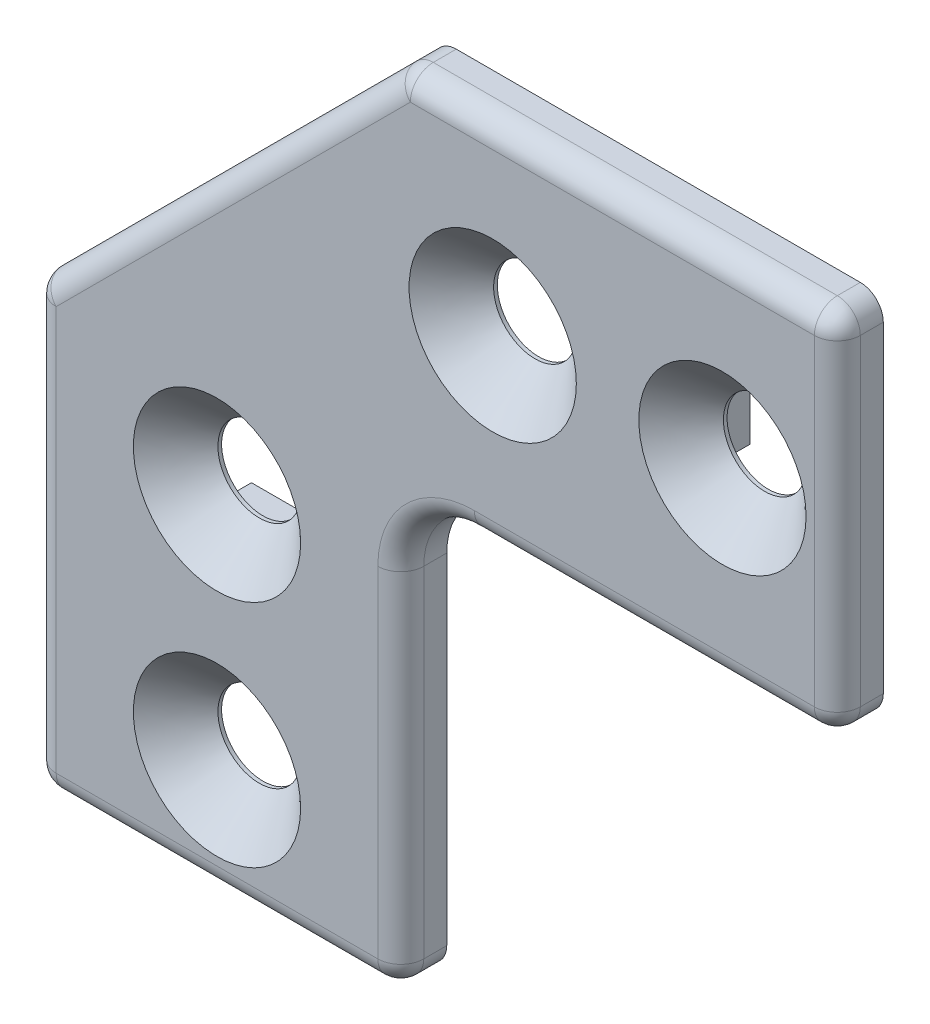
ISO-10303-21;
HEADER;
FILE_DESCRIPTION(('STEP AP214'),'2;1');
FILE_NAME('part.step','',(''),(''),'','','');
FILE_SCHEMA(('AUTOMOTIVE_DESIGN { 1 0 10303 214 1 1 1 1 }'));
ENDSEC;
DATA;
#1=APPLICATION_CONTEXT('core data for automotive mechanical design processes');
#2=APPLICATION_PROTOCOL_DEFINITION('international standard','automotive_design',2000,#1);
#3=PRODUCT_CONTEXT('',#1,'mechanical');
#4=PRODUCT('Part','Part','',(#3));
#5=PRODUCT_RELATED_PRODUCT_CATEGORY('part','',(#4));
#6=PRODUCT_DEFINITION_FORMATION('','',#4);
#7=PRODUCT_DEFINITION_CONTEXT('part definition',#1,'design');
#8=PRODUCT_DEFINITION('design','',#6,#7);
#9=PRODUCT_DEFINITION_SHAPE('','',#8);
#10=(LENGTH_UNIT() NAMED_UNIT(*) SI_UNIT(.MILLI.,.METRE.));
#11=(NAMED_UNIT(*) PLANE_ANGLE_UNIT() SI_UNIT($,.RADIAN.));
#12=(NAMED_UNIT(*) SI_UNIT($,.STERADIAN.) SOLID_ANGLE_UNIT());
#13=UNCERTAINTY_MEASURE_WITH_UNIT(LENGTH_MEASURE(1.E-05),#10,'distance_accuracy_value','');
#14=(GEOMETRIC_REPRESENTATION_CONTEXT(3) GLOBAL_UNCERTAINTY_ASSIGNED_CONTEXT((#13)) GLOBAL_UNIT_ASSIGNED_CONTEXT((#10,
#11,#12)) REPRESENTATION_CONTEXT('',''));
#15=CARTESIAN_POINT('',(0.,0.,0.));
#16=DIRECTION('',(0.,0.,1.));
#17=DIRECTION('',(1.,0.,0.));
#18=AXIS2_PLACEMENT_3D('',#15,#16,#17);
#19=CARTESIAN_POINT('',(20.8633958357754,-20.8633958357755,5.));
#20=DIRECTION('',(0.,0.,1.));
#21=DIRECTION('',(1.,0.,0.));
#22=AXIS2_PLACEMENT_3D('',#19,#20,#21);
#23=PLANE('',#22);
#24=CARTESIAN_POINT('',(0.,-55.0000000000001,5.));
#25=DIRECTION('',(0.,0.,1.));
#26=DIRECTION('',(1.,0.,0.));
#27=AXIS2_PLACEMENT_3D('',#24,#25,#26);
#28=CIRCLE('',#27,9.1);
#29=CARTESIAN_POINT('',(9.1,-55.0000000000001,5.));
#30=VERTEX_POINT('',#29);
#31=EDGE_CURVE('E36',#30,#30,#28,.F.);
#32=ORIENTED_EDGE('',*,*,#31,.T.);
#33=EDGE_LOOP('',(#32));
#34=FACE_BOUND('',#33,.T.);
#35=CARTESIAN_POINT('',(0.,-30.0000000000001,5.));
#36=DIRECTION('',(0.,0.,1.));
#37=DIRECTION('',(0.,-1.,0.));
#38=AXIS2_PLACEMENT_3D('',#35,#36,#37);
#39=CIRCLE('',#38,9.1);
#40=CARTESIAN_POINT('',(9.1,-30.0000000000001,5.));
#41=VERTEX_POINT('',#40);
#42=EDGE_CURVE('E164',#41,#41,#39,.F.);
#43=ORIENTED_EDGE('',*,*,#42,.T.);
#44=EDGE_LOOP('',(#43));
#45=FACE_BOUND('',#44,.T.);
#46=CARTESIAN_POINT('',(30.,0.,5.));
#47=DIRECTION('',(0.,0.,1.));
#48=DIRECTION('',(0.,-1.,0.));
#49=AXIS2_PLACEMENT_3D('',#46,#47,#48);
#50=CIRCLE('',#49,9.1);
#51=CARTESIAN_POINT('',(39.1,0.,5.));
#52=VERTEX_POINT('',#51);
#53=EDGE_CURVE('E163',#52,#52,#50,.F.);
#54=ORIENTED_EDGE('',*,*,#53,.T.);
#55=EDGE_LOOP('',(#54));
#56=FACE_BOUND('',#55,.T.);
#57=CARTESIAN_POINT('',(55.,0.,5.));
#58=DIRECTION('',(0.,0.,1.));
#59=DIRECTION('',(0.,-1.,0.));
#60=AXIS2_PLACEMENT_3D('',#57,#58,#59);
#61=CIRCLE('',#60,9.1);
#62=CARTESIAN_POINT('',(64.1,0.,5.));
#63=VERTEX_POINT('',#62);
#64=EDGE_CURVE('E159',#63,#63,#61,.F.);
#65=ORIENTED_EDGE('',*,*,#64,.T.);
#66=EDGE_LOOP('',(#65));
#67=FACE_BOUND('',#66,.T.);
#68=DIRECTION('',(0.,1.,0.));
#69=VECTOR('',#68,1.);
#70=CARTESIAN_POINT('',(-17.5,-42.9316979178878,5.));
#71=LINE('',#70,#69);
#72=CARTESIAN_POINT('',(-17.5,-65.0000000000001,5.));
#73=VERTEX_POINT('',#72);
#74=CARTESIAN_POINT('',(-17.5,-21.03553391,5.));
#75=VERTEX_POINT('',#74);
#76=EDGE_CURVE('E179',#73,#75,#71,.T.);
#77=ORIENTED_EDGE('',*,*,#76,.F.);
#78=DIRECTION('',(-1.,0.,0.));
#79=VECTOR('',#78,1.);
#80=CARTESIAN_POINT('',(19.1816979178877,-65.0000000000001,5.));
#81=LINE('',#80,#79);
#82=CARTESIAN_POINT('',(17.5,-64.9999999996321,5.));
#83=VERTEX_POINT('',#82);
#84=EDGE_CURVE('E433',#83,#73,#81,.T.);
#85=ORIENTED_EDGE('',*,*,#84,.F.);
#86=DIRECTION('',(0.,-1.,0.));
#87=VECTOR('',#86,1.);
#88=CARTESIAN_POINT('',(17.5,-24.4316979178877,5.));
#89=LINE('',#88,#87);
#90=CARTESIAN_POINT('',(17.5,-28.,5.));
#91=VERTEX_POINT('',#90);
#92=EDGE_CURVE('E261',#91,#83,#89,.T.);
#93=ORIENTED_EDGE('',*,*,#92,.F.);
#94=CARTESIAN_POINT('',(27.9999999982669,-27.9999999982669,5.));
#95=DIRECTION('',(0.,0.,1.));
#96=DIRECTION('',(2.1663722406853E-10,1.,0.));
#97=AXIS2_PLACEMENT_3D('',#94,#95,#96);
#98=CIRCLE('',#97,10.4999999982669);
#99=CARTESIAN_POINT('',(28.0000000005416,-17.5,5.));
#100=VERTEX_POINT('',#99);
#101=EDGE_CURVE('E228',#100,#91,#98,.T.);
#102=ORIENTED_EDGE('',*,*,#101,.F.);
#103=DIRECTION('',(-1.,0.,0.));
#104=VECTOR('',#103,1.);
#105=CARTESIAN_POINT('',(42.9316979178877,-17.5,5.));
#106=LINE('',#105,#104);
#107=CARTESIAN_POINT('',(65.,-17.5000000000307,5.));
#108=VERTEX_POINT('',#107);
#109=EDGE_CURVE('E218',#108,#100,#106,.T.);
#110=ORIENTED_EDGE('',*,*,#109,.F.);
#111=DIRECTION('',(0.,-1.,0.));
#112=VECTOR('',#111,1.);
#113=CARTESIAN_POINT('',(65.,-1.68169791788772,5.));
#114=LINE('',#113,#112);
#115=CARTESIAN_POINT('',(65.,17.4999999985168,5.));
#116=VERTEX_POINT('',#115);
#117=EDGE_CURVE('E63',#116,#108,#114,.T.);
#118=ORIENTED_EDGE('',*,*,#117,.F.);
#119=DIRECTION('',(1.,0.,0.));
#120=VECTOR('',#119,1.);
#121=CARTESIAN_POINT('',(20.9494648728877,17.4999999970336,5.));
#122=LINE('',#121,#120);
#123=CARTESIAN_POINT('',(21.03553391,17.5,5.));
#124=VERTEX_POINT('',#123);
#125=EDGE_CURVE('E57',#124,#116,#122,.T.);
#126=ORIENTED_EDGE('',*,*,#125,.F.);
#127=DIRECTION('',(0.707106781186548,0.707106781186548,0.));
#128=VECTOR('',#127,1.);
#129=CARTESIAN_POINT('',(-7.8661165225,-11.4016504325,5.));
#130=LINE('',#129,#128);
#131=EDGE_CURVE('E194',#75,#124,#130,.T.);
#132=ORIENTED_EDGE('',*,*,#131,.F.);
#133=EDGE_LOOP('',(#77,#85,#93,#102,#110,#118,#126,#132));
#134=FACE_BOUND('',#133,.T.);
#135=ADVANCED_FACE('F18',(#34,#45,#56,#67,#134),#23,.T.);
#136=CARTESIAN_POINT('',(17.5,-24.4316979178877,2.5));
#137=DIRECTION('',(0.,-1.,0.));
#138=DIRECTION('',(0.,0.,-1.));
#139=AXIS2_PLACEMENT_3D('',#136,#137,#138);
#140=CYLINDRICAL_SURFACE('',#139,2.5);
#141=CARTESIAN_POINT('',(17.5,-65.,2.5));
#142=DIRECTION('',(0.,-1.,1.96260402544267E-10));
#143=DIRECTION('',(1.,0.,0.));
#144=AXIS2_PLACEMENT_3D('',#141,#142,#143);
#145=CIRCLE('',#144,2.5);
#146=CARTESIAN_POINT('',(20.,-64.9999999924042,2.5));
#147=VERTEX_POINT('',#146);
#148=EDGE_CURVE('E176',#147,#83,#145,.T.);
#149=ORIENTED_EDGE('',*,*,#148,.F.);
#150=DIRECTION('',(0.,1.,0.));
#151=VECTOR('',#150,1.);
#152=CARTESIAN_POINT('',(20.,-28.,2.5));
#153=LINE('',#152,#151);
#154=CARTESIAN_POINT('',(20.,-27.9999999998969,2.5));
#155=VERTEX_POINT('',#154);
#156=EDGE_CURVE('E168',#155,#147,#153,.F.);
#157=ORIENTED_EDGE('',*,*,#156,.F.);
#158=CARTESIAN_POINT('',(17.5,-28.,2.5));
#159=DIRECTION('',(1.65058066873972E-10,-1.,0.));
#160=DIRECTION('',(-1.,-1.65058066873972E-10,0.));
#161=AXIS2_PLACEMENT_3D('',#158,#159,#160);
#162=CIRCLE('',#161,2.5);
#163=EDGE_CURVE('E221',#91,#155,#162,.F.);
#164=ORIENTED_EDGE('',*,*,#163,.F.);
#165=ORIENTED_EDGE('',*,*,#92,.T.);
#166=EDGE_LOOP('',(#149,#157,#164,#165));
#167=FACE_BOUND('',#166,.T.);
#168=ADVANCED_FACE('F246',(#167),#140,.T.);
#169=CARTESIAN_POINT('',(27.9999999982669,-27.9999999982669,2.5));
#170=DIRECTION('',(0.,0.,1.));
#171=DIRECTION('',(1.,0.,0.));
#172=AXIS2_PLACEMENT_3D('',#169,#170,#171);
#173=TOROIDAL_SURFACE('',#172,10.4999999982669,2.5);
#174=ORIENTED_EDGE('',*,*,#163,.T.);
#175=CARTESIAN_POINT('',(27.9999999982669,-27.9999999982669,2.5));
#176=DIRECTION('',(0.,0.,1.));
#177=DIRECTION('',(1.,0.,0.));
#178=AXIS2_PLACEMENT_3D('',#175,#176,#177);
#179=CIRCLE('',#178,7.9999999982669);
#180=CARTESIAN_POINT('',(28.0000000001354,-20.,2.5));
#181=VERTEX_POINT('',#180);
#182=EDGE_CURVE('E507',#155,#181,#179,.F.);
#183=ORIENTED_EDGE('',*,*,#182,.T.);
#184=CARTESIAN_POINT('',(28.0000000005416,-17.5,2.5));
#185=DIRECTION('',(-1.,0.,0.));
#186=DIRECTION('',(0.,0.,1.));
#187=AXIS2_PLACEMENT_3D('',#184,#185,#186);
#188=CIRCLE('',#187,2.5);
#189=EDGE_CURVE('E220',#100,#181,#188,.F.);
#190=ORIENTED_EDGE('',*,*,#189,.F.);
#191=ORIENTED_EDGE('',*,*,#101,.T.);
#192=EDGE_LOOP('',(#174,#183,#190,#191));
#193=FACE_BOUND('',#192,.T.);
#194=ADVANCED_FACE('F234',(#193),#173,.T.);
#195=CARTESIAN_POINT('',(42.9316979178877,-17.5,2.5));
#196=DIRECTION('',(-1.,0.,0.));
#197=DIRECTION('',(0.,0.,1.));
#198=AXIS2_PLACEMENT_3D('',#195,#196,#197);
#199=CYLINDRICAL_SURFACE('',#198,2.5);
#200=ORIENTED_EDGE('',*,*,#189,.T.);
#201=DIRECTION('',(1.,0.,0.));
#202=VECTOR('',#201,1.);
#203=CARTESIAN_POINT('',(65.,-20.,2.5));
#204=LINE('',#203,#202);
#205=CARTESIAN_POINT('',(65.,-20.,2.5));
#206=VERTEX_POINT('',#205);
#207=EDGE_CURVE('E504',#206,#181,#204,.F.);
#208=ORIENTED_EDGE('',*,*,#207,.F.);
#209=CARTESIAN_POINT('',(65.,-17.5,2.5));
#210=DIRECTION('',(1.,0.,0.));
#211=DIRECTION('',(0.,1.,0.));
#212=AXIS2_PLACEMENT_3D('',#209,#210,#211);
#213=CIRCLE('',#212,2.5);
#214=EDGE_CURVE('E217',#108,#206,#213,.T.);
#215=ORIENTED_EDGE('',*,*,#214,.F.);
#216=ORIENTED_EDGE('',*,*,#109,.T.);
#217=EDGE_LOOP('',(#200,#208,#215,#216));
#218=FACE_BOUND('',#217,.T.);
#219=ADVANCED_FACE('F245',(#218),#199,.T.);
#220=CARTESIAN_POINT('',(65.,-17.5,2.5));
#221=DIRECTION('',(1.,0.,0.));
#222=DIRECTION('',(0.,1.,0.));
#223=AXIS2_PLACEMENT_3D('',#220,#221,#222);
#224=SPHERICAL_SURFACE('',#223,2.5);
#225=CARTESIAN_POINT('',(64.9999999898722,-17.4999999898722,2.5));
#226=DIRECTION('',(0.,0.,1.));
#227=DIRECTION('',(1.,0.,0.));
#228=AXIS2_PLACEMENT_3D('',#225,#226,#227);
#229=CIRCLE('',#228,2.50000001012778);
#230=CARTESIAN_POINT('',(67.5,-17.5,2.5));
#231=VERTEX_POINT('',#230);
#232=EDGE_CURVE('E495',#231,#206,#229,.F.);
#233=ORIENTED_EDGE('',*,*,#232,.F.);
#234=CARTESIAN_POINT('',(65.,-17.5,2.5));
#235=DIRECTION('',(0.,-1.,0.));
#236=DIRECTION('',(1.,0.,0.));
#237=AXIS2_PLACEMENT_3D('',#234,#235,#236);
#238=CIRCLE('',#237,2.5);
#239=EDGE_CURVE('E216',#108,#231,#238,.F.);
#240=ORIENTED_EDGE('',*,*,#239,.F.);
#241=ORIENTED_EDGE('',*,*,#214,.T.);
#242=EDGE_LOOP('',(#233,#240,#241));
#243=FACE_BOUND('',#242,.T.);
#244=ADVANCED_FACE('F511',(#243),#224,.T.);
#245=CARTESIAN_POINT('',(65.,-1.68169791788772,2.5));
#246=DIRECTION('',(0.,-1.,0.));
#247=DIRECTION('',(1.,0.,0.));
#248=AXIS2_PLACEMENT_3D('',#245,#246,#247);
#249=CYLINDRICAL_SURFACE('',#248,2.5);
#250=ORIENTED_EDGE('',*,*,#239,.T.);
#251=DIRECTION('',(0.,1.,0.));
#252=VECTOR('',#251,1.);
#253=CARTESIAN_POINT('',(67.5,17.5,2.5));
#254=LINE('',#253,#252);
#255=CARTESIAN_POINT('',(67.5,17.4999999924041,2.5));
#256=VERTEX_POINT('',#255);
#257=EDGE_CURVE('E491',#256,#231,#254,.F.);
#258=ORIENTED_EDGE('',*,*,#257,.F.);
#259=CARTESIAN_POINT('',(65.,17.5,2.5));
#260=DIRECTION('',(0.,-1.,0.));
#261=DIRECTION('',(1.,0.,0.));
#262=AXIS2_PLACEMENT_3D('',#259,#260,#261);
#263=CIRCLE('',#262,2.5);
#264=EDGE_CURVE('E214',#116,#256,#263,.F.);
#265=ORIENTED_EDGE('',*,*,#264,.F.);
#266=ORIENTED_EDGE('',*,*,#117,.T.);
#267=EDGE_LOOP('',(#250,#258,#265,#266));
#268=FACE_BOUND('',#267,.T.);
#269=ADVANCED_FACE('F486',(#268),#249,.T.);
#270=CARTESIAN_POINT('',(65.,17.5,2.5));
#271=DIRECTION('',(1.,0.,0.));
#272=DIRECTION('',(0.,1.,0.));
#273=AXIS2_PLACEMENT_3D('',#270,#271,#272);
#274=SPHERICAL_SURFACE('',#273,2.5);
#275=CARTESIAN_POINT('',(64.9999999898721,17.4999999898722,2.5));
#276=DIRECTION('',(0.,0.,1.));
#277=DIRECTION('',(1.,0.,0.));
#278=AXIS2_PLACEMENT_3D('',#275,#276,#277);
#279=CIRCLE('',#278,2.50000001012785);
#280=CARTESIAN_POINT('',(65.,20.,2.5));
#281=VERTEX_POINT('',#280);
#282=EDGE_CURVE('E535',#281,#256,#279,.F.);
#283=ORIENTED_EDGE('',*,*,#282,.F.);
#284=CARTESIAN_POINT('',(65.,17.5,2.5));
#285=DIRECTION('',(1.,0.,0.));
#286=DIRECTION('',(0.,0.,-1.));
#287=AXIS2_PLACEMENT_3D('',#284,#285,#286);
#288=CIRCLE('',#287,2.5);
#289=EDGE_CURVE('E208',#116,#281,#288,.F.);
#290=ORIENTED_EDGE('',*,*,#289,.F.);
#291=ORIENTED_EDGE('',*,*,#264,.T.);
#292=EDGE_LOOP('',(#283,#290,#291));
#293=FACE_BOUND('',#292,.T.);
#294=ADVANCED_FACE('F481',(#293),#274,.T.);
#295=CARTESIAN_POINT('',(20.9494648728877,17.5,2.5));
#296=DIRECTION('',(1.,0.,0.));
#297=DIRECTION('',(0.,0.,-1.));
#298=AXIS2_PLACEMENT_3D('',#295,#296,#297);
#299=CYLINDRICAL_SURFACE('',#298,2.5);
#300=ORIENTED_EDGE('',*,*,#289,.T.);
#301=DIRECTION('',(1.,0.,0.));
#302=VECTOR('',#301,1.);
#303=CARTESIAN_POINT('',(21.03553391,20.,2.5));
#304=LINE('',#303,#302);
#305=CARTESIAN_POINT('',(21.0355339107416,19.9999999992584,2.5));
#306=VERTEX_POINT('',#305);
#307=EDGE_CURVE('E468',#306,#281,#304,.T.);
#308=ORIENTED_EDGE('',*,*,#307,.F.);
#309=CARTESIAN_POINT('',(21.0355339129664,17.4999999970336,2.5));
#310=DIRECTION('',(1.,0.,0.));
#311=DIRECTION('',(0.,1.,0.));
#312=AXIS2_PLACEMENT_3D('',#309,#310,#311);
#313=CIRCLE('',#312,2.5);
#314=EDGE_CURVE('E202',#124,#306,#313,.F.);
#315=ORIENTED_EDGE('',*,*,#314,.F.);
#316=ORIENTED_EDGE('',*,*,#125,.T.);
#317=EDGE_LOOP('',(#300,#308,#315,#316));
#318=FACE_BOUND('',#317,.T.);
#319=ADVANCED_FACE('F477',(#318),#299,.T.);
#320=CARTESIAN_POINT('',(21.0355339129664,17.4999999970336,2.5));
#321=DIRECTION('',(1.,0.,0.));
#322=DIRECTION('',(0.,1.,0.));
#323=AXIS2_PLACEMENT_3D('',#320,#321,#322);
#324=SPHERICAL_SURFACE('',#323,2.5);
#325=CARTESIAN_POINT('',(21.0355339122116,17.5000000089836,2.5));
#326=DIRECTION('',(0.,0.,1.));
#327=DIRECTION('',(1.,0.,0.));
#328=AXIS2_PLACEMENT_3D('',#325,#326,#327);
#329=CIRCLE('',#328,2.49999999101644);
#330=CARTESIAN_POINT('',(19.2677669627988,19.2677669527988,2.5));
#331=VERTEX_POINT('',#330);
#332=EDGE_CURVE('E462',#331,#306,#329,.F.);
#333=ORIENTED_EDGE('',*,*,#332,.F.);
#334=CARTESIAN_POINT('',(21.0355339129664,17.4999999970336,2.5));
#335=DIRECTION('',(0.707106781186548,0.707106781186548,0.));
#336=DIRECTION('',(-0.707106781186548,0.707106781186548,0.));
#337=AXIS2_PLACEMENT_3D('',#334,#335,#336);
#338=CIRCLE('',#337,2.5);
#339=EDGE_CURVE('E22',#124,#331,#338,.F.);
#340=ORIENTED_EDGE('',*,*,#339,.F.);
#341=ORIENTED_EDGE('',*,*,#314,.T.);
#342=EDGE_LOOP('',(#333,#340,#341));
#343=FACE_BOUND('',#342,.T.);
#344=ADVANCED_FACE('F474',(#343),#324,.T.);
#345=CARTESIAN_POINT('',(-7.86611651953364,-11.4016504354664,2.5));
#346=DIRECTION('',(0.707106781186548,0.707106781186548,0.));
#347=DIRECTION('',(-0.707106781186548,0.707106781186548,0.));
#348=AXIS2_PLACEMENT_3D('',#345,#346,#347);
#349=CYLINDRICAL_SURFACE('',#348,2.5);
#350=ORIENTED_EDGE('',*,*,#339,.T.);
#351=DIRECTION('',(-0.707106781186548,-0.707106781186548,0.));
#352=VECTOR('',#351,1.);
#353=CARTESIAN_POINT('',(-19.26776695,-19.26776696,2.5));
#354=LINE('',#353,#352);
#355=CARTESIAN_POINT('',(-19.2677669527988,-19.2677669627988,2.5));
#356=VERTEX_POINT('',#355);
#357=EDGE_CURVE('E460',#356,#331,#354,.F.);
#358=ORIENTED_EDGE('',*,*,#357,.F.);
#359=CARTESIAN_POINT('',(-17.4999999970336,-21.0355339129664,2.5));
#360=DIRECTION('',(0.707106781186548,0.707106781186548,0.));
#361=DIRECTION('',(-0.707106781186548,0.707106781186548,0.));
#362=AXIS2_PLACEMENT_3D('',#359,#360,#361);
#363=CIRCLE('',#362,2.5);
#364=EDGE_CURVE('E177',#75,#356,#363,.F.);
#365=ORIENTED_EDGE('',*,*,#364,.F.);
#366=ORIENTED_EDGE('',*,*,#131,.T.);
#367=EDGE_LOOP('',(#350,#358,#365,#366));
#368=FACE_BOUND('',#367,.T.);
#369=ADVANCED_FACE('F455',(#368),#349,.T.);
#370=CARTESIAN_POINT('',(-17.5,-21.03553391,2.5));
#371=DIRECTION('',(1.,0.,0.));
#372=DIRECTION('',(0.,1.,0.));
#373=AXIS2_PLACEMENT_3D('',#370,#371,#372);
#374=SPHERICAL_SURFACE('',#373,2.5);
#375=CARTESIAN_POINT('',(-17.5000000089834,-21.0355339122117,2.5));
#376=DIRECTION('',(0.,0.,1.));
#377=DIRECTION('',(1.,0.,0.));
#378=AXIS2_PLACEMENT_3D('',#375,#376,#377);
#379=CIRCLE('',#378,2.49999999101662);
#380=CARTESIAN_POINT('',(-20.,-21.03553391,2.5));
#381=VERTEX_POINT('',#380);
#382=EDGE_CURVE('E573',#381,#356,#379,.F.);
#383=ORIENTED_EDGE('',*,*,#382,.F.);
#384=CARTESIAN_POINT('',(-17.5,-21.03553391,2.5));
#385=DIRECTION('',(0.,1.,0.));
#386=DIRECTION('',(0.,0.,1.));
#387=AXIS2_PLACEMENT_3D('',#384,#385,#386);
#388=CIRCLE('',#387,2.5);
#389=EDGE_CURVE('E190',#75,#381,#388,.F.);
#390=ORIENTED_EDGE('',*,*,#389,.F.);
#391=ORIENTED_EDGE('',*,*,#364,.T.);
#392=EDGE_LOOP('',(#383,#390,#391));
#393=FACE_BOUND('',#392,.T.);
#394=ADVANCED_FACE('F450',(#393),#374,.T.);
#395=CARTESIAN_POINT('',(-17.5,-42.9316979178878,2.5));
#396=DIRECTION('',(0.,1.,0.));
#397=DIRECTION('',(0.,0.,1.));
#398=AXIS2_PLACEMENT_3D('',#395,#396,#397);
#399=CYLINDRICAL_SURFACE('',#398,2.5);
#400=ORIENTED_EDGE('',*,*,#389,.T.);
#401=DIRECTION('',(0.,1.,0.));
#402=VECTOR('',#401,1.);
#403=CARTESIAN_POINT('',(-20.,-65.0000000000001,2.5));
#404=LINE('',#403,#402);
#405=CARTESIAN_POINT('',(-20.,-65.0000000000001,2.5));
#406=VERTEX_POINT('',#405);
#407=EDGE_CURVE('E434',#406,#381,#404,.T.);
#408=ORIENTED_EDGE('',*,*,#407,.F.);
#409=CARTESIAN_POINT('',(-17.5,-65.,2.5));
#410=DIRECTION('',(0.,-1.,0.));
#411=DIRECTION('',(1.,0.,0.));
#412=AXIS2_PLACEMENT_3D('',#409,#410,#411);
#413=CIRCLE('',#412,2.5);
#414=EDGE_CURVE('E441',#73,#406,#413,.T.);
#415=ORIENTED_EDGE('',*,*,#414,.F.);
#416=ORIENTED_EDGE('',*,*,#76,.T.);
#417=EDGE_LOOP('',(#400,#408,#415,#416));
#418=FACE_BOUND('',#417,.T.);
#419=ADVANCED_FACE('F446',(#418),#399,.T.);
#420=CARTESIAN_POINT('',(-17.5,-65.0000000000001,2.5));
#421=DIRECTION('',(1.,0.,0.));
#422=DIRECTION('',(0.,1.,0.));
#423=AXIS2_PLACEMENT_3D('',#420,#421,#422);
#424=SPHERICAL_SURFACE('',#423,2.5);
#425=CARTESIAN_POINT('',(-17.4999999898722,-64.9999999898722,2.5));
#426=DIRECTION('',(0.,0.,1.));
#427=DIRECTION('',(1.,0.,0.));
#428=AXIS2_PLACEMENT_3D('',#425,#426,#427);
#429=CIRCLE('',#428,2.50000001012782);
#430=CARTESIAN_POINT('',(-17.5,-67.5000000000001,2.5));
#431=VERTEX_POINT('',#430);
#432=EDGE_CURVE('E424',#431,#406,#429,.F.);
#433=ORIENTED_EDGE('',*,*,#432,.F.);
#434=CARTESIAN_POINT('',(-17.5,-65.0000000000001,2.5));
#435=DIRECTION('',(-1.,0.,0.));
#436=DIRECTION('',(0.,0.,1.));
#437=AXIS2_PLACEMENT_3D('',#434,#435,#436);
#438=CIRCLE('',#437,2.5);
#439=EDGE_CURVE('E423',#73,#431,#438,.F.);
#440=ORIENTED_EDGE('',*,*,#439,.F.);
#441=ORIENTED_EDGE('',*,*,#414,.T.);
#442=EDGE_LOOP('',(#433,#440,#441));
#443=FACE_BOUND('',#442,.T.);
#444=ADVANCED_FACE('F443',(#443),#424,.T.);
#445=CARTESIAN_POINT('',(19.1816979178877,-65.0000000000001,2.5));
#446=DIRECTION('',(-1.,0.,0.));
#447=DIRECTION('',(0.,0.,1.));
#448=AXIS2_PLACEMENT_3D('',#445,#446,#447);
#449=CYLINDRICAL_SURFACE('',#448,2.5);
#450=ORIENTED_EDGE('',*,*,#439,.T.);
#451=DIRECTION('',(1.,0.,0.));
#452=VECTOR('',#451,1.);
#453=CARTESIAN_POINT('',(17.5,-67.5000000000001,2.5));
#454=LINE('',#453,#452);
#455=CARTESIAN_POINT('',(17.5,-67.5000000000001,2.5));
#456=VERTEX_POINT('',#455);
#457=EDGE_CURVE('E416',#456,#431,#454,.F.);
#458=ORIENTED_EDGE('',*,*,#457,.F.);
#459=CARTESIAN_POINT('',(17.5,-65.0000000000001,2.5));
#460=DIRECTION('',(1.,0.,0.));
#461=DIRECTION('',(0.,1.,0.));
#462=AXIS2_PLACEMENT_3D('',#459,#460,#461);
#463=CIRCLE('',#462,2.5);
#464=EDGE_CURVE('E420',#83,#456,#463,.T.);
#465=ORIENTED_EDGE('',*,*,#464,.F.);
#466=ORIENTED_EDGE('',*,*,#84,.T.);
#467=EDGE_LOOP('',(#450,#458,#465,#466));
#468=FACE_BOUND('',#467,.T.);
#469=ADVANCED_FACE('F410',(#468),#449,.T.);
#470=CARTESIAN_POINT('',(17.5,-65.0000000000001,2.5));
#471=DIRECTION('',(1.,0.,0.));
#472=DIRECTION('',(0.,1.,0.));
#473=AXIS2_PLACEMENT_3D('',#470,#471,#472);
#474=SPHERICAL_SURFACE('',#473,2.5);
#475=CARTESIAN_POINT('',(17.4999999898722,-64.9999999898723,2.5));
#476=DIRECTION('',(0.,0.,1.));
#477=DIRECTION('',(1.,0.,0.));
#478=AXIS2_PLACEMENT_3D('',#475,#476,#477);
#479=CIRCLE('',#478,2.50000001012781);
#480=EDGE_CURVE('E549',#147,#456,#479,.F.);
#481=ORIENTED_EDGE('',*,*,#480,.F.);
#482=ORIENTED_EDGE('',*,*,#148,.T.);
#483=ORIENTED_EDGE('',*,*,#464,.T.);
#484=EDGE_LOOP('',(#481,#482,#483));
#485=FACE_BOUND('',#484,.T.);
#486=ADVANCED_FACE('F405',(#485),#474,.T.);
#487=CARTESIAN_POINT('',(0.,-42.5000000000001,-3.));
#488=DIRECTION('',(0.,0.,1.));
#489=DIRECTION('',(1.,0.,0.));
#490=AXIS2_PLACEMENT_3D('',#487,#488,#489);
#491=PLANE('',#490);
#492=DIRECTION('',(1.,0.,0.));
#493=VECTOR('',#492,1.);
#494=CARTESIAN_POINT('',(4.25,-35.0000000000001,-3.));
#495=LINE('',#494,#493);
#496=CARTESIAN_POINT('',(4.25,-35.0000000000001,-3.));
#497=VERTEX_POINT('',#496);
#498=CARTESIAN_POINT('',(-4.25,-35.0000000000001,-3.));
#499=VERTEX_POINT('',#498);
#500=EDGE_CURVE('E689',#497,#499,#495,.F.);
#501=ORIENTED_EDGE('',*,*,#500,.F.);
#502=DIRECTION('',(0.,1.,0.));
#503=VECTOR('',#502,1.);
#504=CARTESIAN_POINT('',(4.25,-50.0000000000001,-3.));
#505=LINE('',#504,#503);
#506=CARTESIAN_POINT('',(4.25,-50.0000000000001,-3.));
#507=VERTEX_POINT('',#506);
#508=EDGE_CURVE('E686',#507,#497,#505,.T.);
#509=ORIENTED_EDGE('',*,*,#508,.F.);
#510=DIRECTION('',(1.,0.,0.));
#511=VECTOR('',#510,1.);
#512=CARTESIAN_POINT('',(-4.25,-50.0000000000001,-3.));
#513=LINE('',#512,#511);
#514=CARTESIAN_POINT('',(-4.25,-50.0000000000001,-3.));
#515=VERTEX_POINT('',#514);
#516=EDGE_CURVE('E680',#515,#507,#513,.T.);
#517=ORIENTED_EDGE('',*,*,#516,.F.);
#518=DIRECTION('',(0.,1.,0.));
#519=VECTOR('',#518,1.);
#520=CARTESIAN_POINT('',(-4.25,-35.0000000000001,-3.));
#521=LINE('',#520,#519);
#522=EDGE_CURVE('E673',#499,#515,#521,.F.);
#523=ORIENTED_EDGE('',*,*,#522,.F.);
#524=EDGE_LOOP('',(#501,#509,#517,#523));
#525=FACE_BOUND('',#524,.T.);
#526=ADVANCED_FACE('F401',(#525),#491,.F.);
#527=CARTESIAN_POINT('',(42.5,0.,-3.));
#528=DIRECTION('',(0.,0.,1.));
#529=DIRECTION('',(1.,0.,0.));
#530=AXIS2_PLACEMENT_3D('',#527,#528,#529);
#531=PLANE('',#530);
#532=DIRECTION('',(1.,0.,0.));
#533=VECTOR('',#532,1.);
#534=CARTESIAN_POINT('',(50.,4.25,-3.));
#535=LINE('',#534,#533);
#536=CARTESIAN_POINT('',(50.,4.25,-3.));
#537=VERTEX_POINT('',#536);
#538=CARTESIAN_POINT('',(35.,4.25,-3.));
#539=VERTEX_POINT('',#538);
#540=EDGE_CURVE('E664',#537,#539,#535,.F.);
#541=ORIENTED_EDGE('',*,*,#540,.F.);
#542=DIRECTION('',(0.,1.,0.));
#543=VECTOR('',#542,1.);
#544=CARTESIAN_POINT('',(50.,-4.25,-3.));
#545=LINE('',#544,#543);
#546=CARTESIAN_POINT('',(50.,-4.25,-3.));
#547=VERTEX_POINT('',#546);
#548=EDGE_CURVE('E661',#547,#537,#545,.T.);
#549=ORIENTED_EDGE('',*,*,#548,.F.);
#550=DIRECTION('',(1.,0.,0.));
#551=VECTOR('',#550,1.);
#552=CARTESIAN_POINT('',(35.,-4.25,-3.));
#553=LINE('',#552,#551);
#554=CARTESIAN_POINT('',(35.,-4.25,-3.));
#555=VERTEX_POINT('',#554);
#556=EDGE_CURVE('E654',#555,#547,#553,.T.);
#557=ORIENTED_EDGE('',*,*,#556,.F.);
#558=DIRECTION('',(0.,1.,0.));
#559=VECTOR('',#558,1.);
#560=CARTESIAN_POINT('',(35.,4.25,-3.));
#561=LINE('',#560,#559);
#562=EDGE_CURVE('E647',#539,#555,#561,.F.);
#563=ORIENTED_EDGE('',*,*,#562,.F.);
#564=EDGE_LOOP('',(#541,#549,#557,#563));
#565=FACE_BOUND('',#564,.T.);
#566=ADVANCED_FACE('F276',(#565),#531,.F.);
#567=CARTESIAN_POINT('',(0.,-55.0000000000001,5.));
#568=DIRECTION('',(0.,0.,1.));
#569=DIRECTION('',(1.,0.,0.));
#570=AXIS2_PLACEMENT_3D('',#567,#568,#569);
#571=CONICAL_SURFACE('',#570,9.1,0.785398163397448);
#572=ORIENTED_EDGE('',*,*,#31,.F.);
#573=EDGE_LOOP('',(#572));
#574=FACE_BOUND('',#573,.T.);
#575=CARTESIAN_POINT('',(0.,-55.0000000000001,0.399999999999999));
#576=DIRECTION('',(0.,0.,1.));
#577=DIRECTION('',(1.,0.,0.));
#578=AXIS2_PLACEMENT_3D('',#575,#576,#577);
#579=CIRCLE('',#578,4.5);
#580=CARTESIAN_POINT('',(4.5,-55.0000000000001,0.399999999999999));
#581=VERTEX_POINT('',#580);
#582=EDGE_CURVE('E631',#581,#581,#579,.F.);
#583=ORIENTED_EDGE('',*,*,#582,.T.);
#584=EDGE_LOOP('',(#583));
#585=FACE_BOUND('',#584,.T.);
#586=ADVANCED_FACE('F272',(#574,#585),#571,.F.);
#587=CARTESIAN_POINT('',(0.,-30.0000000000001,5.));
#588=DIRECTION('',(0.,0.,1.));
#589=DIRECTION('',(0.,-1.,0.));
#590=AXIS2_PLACEMENT_3D('',#587,#588,#589);
#591=CONICAL_SURFACE('',#590,9.1,0.785398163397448);
#592=ORIENTED_EDGE('',*,*,#42,.F.);
#593=EDGE_LOOP('',(#592));
#594=FACE_BOUND('',#593,.T.);
#595=CARTESIAN_POINT('',(0.,-30.0000000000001,0.399999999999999));
#596=DIRECTION('',(0.,0.,1.));
#597=DIRECTION('',(1.,0.,0.));
#598=AXIS2_PLACEMENT_3D('',#595,#596,#597);
#599=CIRCLE('',#598,4.5);
#600=CARTESIAN_POINT('',(4.5,-30.0000000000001,0.399999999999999));
#601=VERTEX_POINT('',#600);
#602=EDGE_CURVE('E625',#601,#601,#599,.F.);
#603=ORIENTED_EDGE('',*,*,#602,.T.);
#604=EDGE_LOOP('',(#603));
#605=FACE_BOUND('',#604,.T.);
#606=ADVANCED_FACE('F275',(#594,#605),#591,.F.);
#607=CARTESIAN_POINT('',(55.,0.,5.));
#608=DIRECTION('',(0.,0.,1.));
#609=DIRECTION('',(0.,-1.,0.));
#610=AXIS2_PLACEMENT_3D('',#607,#608,#609);
#611=CONICAL_SURFACE('',#610,9.1,0.785398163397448);
#612=ORIENTED_EDGE('',*,*,#64,.F.);
#613=EDGE_LOOP('',(#612));
#614=FACE_BOUND('',#613,.T.);
#615=CARTESIAN_POINT('',(55.,0.,0.399999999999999));
#616=DIRECTION('',(0.,0.,1.));
#617=DIRECTION('',(1.,0.,0.));
#618=AXIS2_PLACEMENT_3D('',#615,#616,#617);
#619=CIRCLE('',#618,4.5);
#620=CARTESIAN_POINT('',(59.5,0.,0.399999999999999));
#621=VERTEX_POINT('',#620);
#622=EDGE_CURVE('E618',#621,#621,#619,.F.);
#623=ORIENTED_EDGE('',*,*,#622,.T.);
#624=EDGE_LOOP('',(#623));
#625=FACE_BOUND('',#624,.T.);
#626=ADVANCED_FACE('F160',(#614,#625),#611,.F.);
#627=CARTESIAN_POINT('',(30.,0.,5.));
#628=DIRECTION('',(0.,0.,1.));
#629=DIRECTION('',(0.,-1.,0.));
#630=AXIS2_PLACEMENT_3D('',#627,#628,#629);
#631=CONICAL_SURFACE('',#630,9.1,0.785398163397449);
#632=ORIENTED_EDGE('',*,*,#53,.F.);
#633=EDGE_LOOP('',(#632));
#634=FACE_BOUND('',#633,.T.);
#635=CARTESIAN_POINT('',(30.,0.,0.399999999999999));
#636=DIRECTION('',(0.,0.,1.));
#637=DIRECTION('',(1.,0.,0.));
#638=AXIS2_PLACEMENT_3D('',#635,#636,#637);
#639=CIRCLE('',#638,4.5);
#640=CARTESIAN_POINT('',(34.5,0.,0.399999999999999));
#641=VERTEX_POINT('',#640);
#642=EDGE_CURVE('E613',#641,#641,#639,.F.);
#643=ORIENTED_EDGE('',*,*,#642,.T.);
#644=EDGE_LOOP('',(#643));
#645=FACE_BOUND('',#644,.T.);
#646=ADVANCED_FACE('F20',(#634,#645),#631,.F.);
#647=CARTESIAN_POINT('',(20.,-28.,0.));
#648=DIRECTION('',(1.,0.,0.));
#649=DIRECTION('',(0.,0.,-1.));
#650=AXIS2_PLACEMENT_3D('',#647,#648,#649);
#651=PLANE('',#650);
#652=DIRECTION('',(0.,1.,0.));
#653=VECTOR('',#652,1.);
#654=CARTESIAN_POINT('',(20.,-20.8633958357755,0.));
#655=LINE('',#654,#653);
#656=CARTESIAN_POINT('',(20.,-64.9999999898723,0.));
#657=VERTEX_POINT('',#656);
#658=CARTESIAN_POINT('',(20.,-27.9999999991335,0.));
#659=VERTEX_POINT('',#658);
#660=EDGE_CURVE('E607',#657,#659,#655,.T.);
#661=ORIENTED_EDGE('',*,*,#660,.T.);
#662=DIRECTION('',(0.,0.,1.));
#663=VECTOR('',#662,1.);
#664=CARTESIAN_POINT('',(20.,-28.,0.));
#665=LINE('',#664,#663);
#666=EDGE_CURVE('E545',#659,#155,#665,.T.);
#667=ORIENTED_EDGE('',*,*,#666,.T.);
#668=ORIENTED_EDGE('',*,*,#156,.T.);
#669=DIRECTION('',(0.,0.,1.));
#670=VECTOR('',#669,1.);
#671=CARTESIAN_POINT('',(20.,-64.9999999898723,0.));
#672=LINE('',#671,#670);
#673=EDGE_CURVE('E557',#657,#147,#672,.T.);
#674=ORIENTED_EDGE('',*,*,#673,.F.);
#675=EDGE_LOOP('',(#661,#667,#668,#674));
#676=FACE_BOUND('',#675,.T.);
#677=ADVANCED_FACE('F286',(#676),#651,.T.);
#678=CARTESIAN_POINT('',(27.9999999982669,-27.9999999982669,0.));
#679=DIRECTION('',(0.,0.,1.));
#680=DIRECTION('',(1.,0.,0.));
#681=AXIS2_PLACEMENT_3D('',#678,#679,#680);
#682=CYLINDRICAL_SURFACE('',#681,7.9999999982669);
#683=ORIENTED_EDGE('',*,*,#666,.F.);
#684=CARTESIAN_POINT('',(27.9999999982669,-27.9999999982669,0.));
#685=DIRECTION('',(0.,0.,1.));
#686=DIRECTION('',(1.,0.,0.));
#687=AXIS2_PLACEMENT_3D('',#684,#685,#686);
#688=CIRCLE('',#687,7.9999999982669);
#689=CARTESIAN_POINT('',(27.9999999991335,-20.,0.));
#690=VERTEX_POINT('',#689);
#691=EDGE_CURVE('E605',#659,#690,#688,.F.);
#692=ORIENTED_EDGE('',*,*,#691,.T.);
#693=DIRECTION('',(0.,0.,-1.));
#694=VECTOR('',#693,1.);
#695=CARTESIAN_POINT('',(28.,-20.,0.));
#696=LINE('',#695,#694);
#697=EDGE_CURVE('E500',#181,#690,#696,.T.);
#698=ORIENTED_EDGE('',*,*,#697,.F.);
#699=ORIENTED_EDGE('',*,*,#182,.F.);
#700=EDGE_LOOP('',(#683,#692,#698,#699));
#701=FACE_BOUND('',#700,.T.);
#702=ADVANCED_FACE('F391',(#701),#682,.F.);
#703=CARTESIAN_POINT('',(65.,-20.,0.));
#704=DIRECTION('',(0.,-1.,0.));
#705=DIRECTION('',(0.,0.,-1.));
#706=AXIS2_PLACEMENT_3D('',#703,#704,#705);
#707=PLANE('',#706);
#708=DIRECTION('',(1.,0.,0.));
#709=VECTOR('',#708,1.);
#710=CARTESIAN_POINT('',(20.8633958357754,-20.,0.));
#711=LINE('',#710,#709);
#712=CARTESIAN_POINT('',(64.9999999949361,-20.,0.));
#713=VERTEX_POINT('',#712);
#714=EDGE_CURVE('E604',#690,#713,#711,.T.);
#715=ORIENTED_EDGE('',*,*,#714,.T.);
#716=DIRECTION('',(0.,0.,1.));
#717=VECTOR('',#716,1.);
#718=CARTESIAN_POINT('',(65.,-20.,0.));
#719=LINE('',#718,#717);
#720=EDGE_CURVE('E499',#206,#713,#719,.F.);
#721=ORIENTED_EDGE('',*,*,#720,.F.);
#722=ORIENTED_EDGE('',*,*,#207,.T.);
#723=ORIENTED_EDGE('',*,*,#697,.T.);
#724=EDGE_LOOP('',(#715,#721,#722,#723));
#725=FACE_BOUND('',#724,.T.);
#726=ADVANCED_FACE('F387',(#725),#707,.T.);
#727=CARTESIAN_POINT('',(64.9999999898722,-17.4999999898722,0.));
#728=DIRECTION('',(0.,0.,1.));
#729=DIRECTION('',(1.,0.,0.));
#730=AXIS2_PLACEMENT_3D('',#727,#728,#729);
#731=CYLINDRICAL_SURFACE('',#730,2.50000001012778);
#732=CARTESIAN_POINT('',(64.9999999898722,-17.4999999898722,0.));
#733=DIRECTION('',(0.,0.,1.));
#734=DIRECTION('',(1.,0.,0.));
#735=AXIS2_PLACEMENT_3D('',#732,#733,#734);
#736=CIRCLE('',#735,2.50000001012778);
#737=CARTESIAN_POINT('',(67.5,-17.4999999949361,0.));
#738=VERTEX_POINT('',#737);
#739=EDGE_CURVE('E530',#713,#738,#736,.T.);
#740=ORIENTED_EDGE('',*,*,#739,.T.);
#741=DIRECTION('',(0.,0.,-1.));
#742=VECTOR('',#741,1.);
#743=CARTESIAN_POINT('',(67.5,-17.5,0.));
#744=LINE('',#743,#742);
#745=EDGE_CURVE('E528',#231,#738,#744,.T.);
#746=ORIENTED_EDGE('',*,*,#745,.F.);
#747=ORIENTED_EDGE('',*,*,#232,.T.);
#748=ORIENTED_EDGE('',*,*,#720,.T.);
#749=EDGE_LOOP('',(#740,#746,#747,#748));
#750=FACE_BOUND('',#749,.T.);
#751=ADVANCED_FACE('F383',(#750),#731,.T.);
#752=CARTESIAN_POINT('',(67.5,17.5,0.));
#753=DIRECTION('',(1.,0.,0.));
#754=DIRECTION('',(0.,0.,-1.));
#755=AXIS2_PLACEMENT_3D('',#752,#753,#754);
#756=PLANE('',#755);
#757=DIRECTION('',(0.,1.,0.));
#758=VECTOR('',#757,1.);
#759=CARTESIAN_POINT('',(67.5,-20.8633958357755,0.));
#760=LINE('',#759,#758);
#761=CARTESIAN_POINT('',(67.5,17.4999999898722,0.));
#762=VERTEX_POINT('',#761);
#763=EDGE_CURVE('E597',#738,#762,#760,.T.);
#764=ORIENTED_EDGE('',*,*,#763,.T.);
#765=DIRECTION('',(0.,0.,1.));
#766=VECTOR('',#765,1.);
#767=CARTESIAN_POINT('',(67.5,17.4999999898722,0.));
#768=LINE('',#767,#766);
#769=EDGE_CURVE('E471',#256,#762,#768,.F.);
#770=ORIENTED_EDGE('',*,*,#769,.F.);
#771=ORIENTED_EDGE('',*,*,#257,.T.);
#772=ORIENTED_EDGE('',*,*,#745,.T.);
#773=EDGE_LOOP('',(#764,#770,#771,#772));
#774=FACE_BOUND('',#773,.T.);
#775=ADVANCED_FACE('F379',(#774),#756,.T.);
#776=CARTESIAN_POINT('',(64.9999999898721,17.4999999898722,0.));
#777=DIRECTION('',(0.,0.,1.));
#778=DIRECTION('',(1.,0.,0.));
#779=AXIS2_PLACEMENT_3D('',#776,#777,#778);
#780=CYLINDRICAL_SURFACE('',#779,2.50000001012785);
#781=CARTESIAN_POINT('',(64.9999999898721,17.4999999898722,0.));
#782=DIRECTION('',(0.,0.,1.));
#783=DIRECTION('',(1.,0.,0.));
#784=AXIS2_PLACEMENT_3D('',#781,#782,#783);
#785=CIRCLE('',#784,2.50000001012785);
#786=CARTESIAN_POINT('',(64.9999999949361,20.,0.));
#787=VERTEX_POINT('',#786);
#788=EDGE_CURVE('E590',#762,#787,#785,.T.);
#789=ORIENTED_EDGE('',*,*,#788,.T.);
#790=DIRECTION('',(0.,0.,1.));
#791=VECTOR('',#790,1.);
#792=CARTESIAN_POINT('',(65.,20.,0.));
#793=LINE('',#792,#791);
#794=EDGE_CURVE('E467',#281,#787,#793,.F.);
#795=ORIENTED_EDGE('',*,*,#794,.F.);
#796=ORIENTED_EDGE('',*,*,#282,.T.);
#797=ORIENTED_EDGE('',*,*,#769,.T.);
#798=EDGE_LOOP('',(#789,#795,#796,#797));
#799=FACE_BOUND('',#798,.T.);
#800=ADVANCED_FACE('F375',(#799),#780,.T.);
#801=CARTESIAN_POINT('',(21.03553391,20.,0.));
#802=DIRECTION('',(0.,1.,0.));
#803=DIRECTION('',(0.,0.,1.));
#804=AXIS2_PLACEMENT_3D('',#801,#802,#803);
#805=PLANE('',#804);
#806=DIRECTION('',(1.,0.,0.));
#807=VECTOR('',#806,1.);
#808=CARTESIAN_POINT('',(20.8633958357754,20.,0.));
#809=LINE('',#808,#807);
#810=CARTESIAN_POINT('',(21.0355339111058,20.,0.));
#811=VERTEX_POINT('',#810);
#812=EDGE_CURVE('E582',#787,#811,#809,.F.);
#813=ORIENTED_EDGE('',*,*,#812,.T.);
#814=DIRECTION('',(0.,0.,1.));
#815=VECTOR('',#814,1.);
#816=CARTESIAN_POINT('',(21.03553391,20.,0.));
#817=LINE('',#816,#815);
#818=EDGE_CURVE('E466',#306,#811,#817,.F.);
#819=ORIENTED_EDGE('',*,*,#818,.F.);
#820=ORIENTED_EDGE('',*,*,#307,.T.);
#821=ORIENTED_EDGE('',*,*,#794,.T.);
#822=EDGE_LOOP('',(#813,#819,#820,#821));
#823=FACE_BOUND('',#822,.T.);
#824=ADVANCED_FACE('F371',(#823),#805,.T.);
#825=CARTESIAN_POINT('',(21.0355339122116,17.5000000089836,0.));
#826=DIRECTION('',(0.,0.,1.));
#827=DIRECTION('',(1.,0.,0.));
#828=AXIS2_PLACEMENT_3D('',#825,#826,#827);
#829=CYLINDRICAL_SURFACE('',#828,2.49999999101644);
#830=CARTESIAN_POINT('',(21.0355339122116,17.5000000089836,0.));
#831=DIRECTION('',(0.,0.,1.));
#832=DIRECTION('',(1.,0.,0.));
#833=AXIS2_PLACEMENT_3D('',#830,#831,#832);
#834=CIRCLE('',#833,2.49999999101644);
#835=CARTESIAN_POINT('',(19.2677669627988,19.2677669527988,0.));
#836=VERTEX_POINT('',#835);
#837=EDGE_CURVE('E593',#811,#836,#834,.T.);
#838=ORIENTED_EDGE('',*,*,#837,.T.);
#839=DIRECTION('',(0.,0.,1.));
#840=VECTOR('',#839,1.);
#841=CARTESIAN_POINT('',(19.26776696,19.26776695,0.));
#842=LINE('',#841,#840);
#843=EDGE_CURVE('E574',#331,#836,#842,.F.);
#844=ORIENTED_EDGE('',*,*,#843,.F.);
#845=ORIENTED_EDGE('',*,*,#332,.T.);
#846=ORIENTED_EDGE('',*,*,#818,.T.);
#847=EDGE_LOOP('',(#838,#844,#845,#846));
#848=FACE_BOUND('',#847,.T.);
#849=ADVANCED_FACE('F367',(#848),#829,.T.);
#850=CARTESIAN_POINT('',(-19.26776695,-19.26776696,0.));
#851=DIRECTION('',(-0.707106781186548,0.707106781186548,0.));
#852=DIRECTION('',(-0.707106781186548,-0.707106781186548,0.));
#853=AXIS2_PLACEMENT_3D('',#850,#851,#852);
#854=PLANE('',#853);
#855=DIRECTION('',(-0.707106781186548,-0.707106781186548,0.));
#856=VECTOR('',#855,1.);
#857=CARTESIAN_POINT('',(19.26776696,19.26776695,0.));
#858=LINE('',#857,#856);
#859=CARTESIAN_POINT('',(-19.2677669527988,-19.2677669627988,0.));
#860=VERTEX_POINT('',#859);
#861=EDGE_CURVE('E731',#836,#860,#858,.T.);
#862=ORIENTED_EDGE('',*,*,#861,.T.);
#863=DIRECTION('',(0.,0.,1.));
#864=VECTOR('',#863,1.);
#865=CARTESIAN_POINT('',(-19.26776695,-19.26776696,0.));
#866=LINE('',#865,#864);
#867=EDGE_CURVE('E438',#356,#860,#866,.F.);
#868=ORIENTED_EDGE('',*,*,#867,.F.);
#869=ORIENTED_EDGE('',*,*,#357,.T.);
#870=ORIENTED_EDGE('',*,*,#843,.T.);
#871=EDGE_LOOP('',(#862,#868,#869,#870));
#872=FACE_BOUND('',#871,.T.);
#873=ADVANCED_FACE('F363',(#872),#854,.T.);
#874=CARTESIAN_POINT('',(-17.5000000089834,-21.0355339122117,0.));
#875=DIRECTION('',(0.,0.,1.));
#876=DIRECTION('',(1.,0.,0.));
#877=AXIS2_PLACEMENT_3D('',#874,#875,#876);
#878=CYLINDRICAL_SURFACE('',#877,2.49999999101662);
#879=CARTESIAN_POINT('',(-17.5000000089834,-21.0355339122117,0.));
#880=DIRECTION('',(0.,0.,1.));
#881=DIRECTION('',(1.,0.,0.));
#882=AXIS2_PLACEMENT_3D('',#879,#880,#881);
#883=CIRCLE('',#882,2.49999999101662);
#884=CARTESIAN_POINT('',(-20.,-21.0355339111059,0.));
#885=VERTEX_POINT('',#884);
#886=EDGE_CURVE('E729',#860,#885,#883,.T.);
#887=ORIENTED_EDGE('',*,*,#886,.T.);
#888=DIRECTION('',(0.,0.,1.));
#889=VECTOR('',#888,1.);
#890=CARTESIAN_POINT('',(-20.,-21.03553391,0.));
#891=LINE('',#890,#889);
#892=EDGE_CURVE('E429',#381,#885,#891,.F.);
#893=ORIENTED_EDGE('',*,*,#892,.F.);
#894=ORIENTED_EDGE('',*,*,#382,.T.);
#895=ORIENTED_EDGE('',*,*,#867,.T.);
#896=EDGE_LOOP('',(#887,#893,#894,#895));
#897=FACE_BOUND('',#896,.T.);
#898=ADVANCED_FACE('F359',(#897),#878,.T.);
#899=CARTESIAN_POINT('',(-20.,-65.0000000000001,0.));
#900=DIRECTION('',(-1.,0.,0.));
#901=DIRECTION('',(0.,0.,1.));
#902=AXIS2_PLACEMENT_3D('',#899,#900,#901);
#903=PLANE('',#902);
#904=DIRECTION('',(0.,1.,0.));
#905=VECTOR('',#904,1.);
#906=CARTESIAN_POINT('',(-20.,-20.8633958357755,0.));
#907=LINE('',#906,#905);
#908=CARTESIAN_POINT('',(-20.,-64.9999999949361,0.));
#909=VERTEX_POINT('',#908);
#910=EDGE_CURVE('E728',#885,#909,#907,.F.);
#911=ORIENTED_EDGE('',*,*,#910,.T.);
#912=DIRECTION('',(0.,0.,1.));
#913=VECTOR('',#912,1.);
#914=CARTESIAN_POINT('',(-20.,-65.0000000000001,0.));
#915=LINE('',#914,#913);
#916=EDGE_CURVE('E428',#406,#909,#915,.F.);
#917=ORIENTED_EDGE('',*,*,#916,.F.);
#918=ORIENTED_EDGE('',*,*,#407,.T.);
#919=ORIENTED_EDGE('',*,*,#892,.T.);
#920=EDGE_LOOP('',(#911,#917,#918,#919));
#921=FACE_BOUND('',#920,.T.);
#922=ADVANCED_FACE('F355',(#921),#903,.T.);
#923=CARTESIAN_POINT('',(-17.4999999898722,-64.9999999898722,0.));
#924=DIRECTION('',(0.,0.,1.));
#925=DIRECTION('',(1.,0.,0.));
#926=AXIS2_PLACEMENT_3D('',#923,#924,#925);
#927=CYLINDRICAL_SURFACE('',#926,2.50000001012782);
#928=CARTESIAN_POINT('',(-17.4999999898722,-64.9999999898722,0.));
#929=DIRECTION('',(0.,0.,1.));
#930=DIRECTION('',(1.,0.,0.));
#931=AXIS2_PLACEMENT_3D('',#928,#929,#930);
#932=CIRCLE('',#931,2.50000001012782);
#933=CARTESIAN_POINT('',(-17.4999999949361,-67.5000000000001,0.));
#934=VERTEX_POINT('',#933);
#935=EDGE_CURVE('E721',#909,#934,#932,.T.);
#936=ORIENTED_EDGE('',*,*,#935,.T.);
#937=DIRECTION('',(0.,0.,-1.));
#938=VECTOR('',#937,1.);
#939=CARTESIAN_POINT('',(-17.5,-67.5000000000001,0.));
#940=LINE('',#939,#938);
#941=EDGE_CURVE('E552',#431,#934,#940,.T.);
#942=ORIENTED_EDGE('',*,*,#941,.F.);
#943=ORIENTED_EDGE('',*,*,#432,.T.);
#944=ORIENTED_EDGE('',*,*,#916,.T.);
#945=EDGE_LOOP('',(#936,#942,#943,#944));
#946=FACE_BOUND('',#945,.T.);
#947=ADVANCED_FACE('F351',(#946),#927,.T.);
#948=CARTESIAN_POINT('',(17.5,-67.5000000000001,0.));
#949=DIRECTION('',(0.,-1.,0.));
#950=DIRECTION('',(0.,0.,-1.));
#951=AXIS2_PLACEMENT_3D('',#948,#949,#950);
#952=PLANE('',#951);
#953=DIRECTION('',(1.,0.,0.));
#954=VECTOR('',#953,1.);
#955=CARTESIAN_POINT('',(20.8633958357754,-67.5000000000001,0.));
#956=LINE('',#955,#954);
#957=CARTESIAN_POINT('',(17.4999999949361,-67.5000000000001,0.));
#958=VERTEX_POINT('',#957);
#959=EDGE_CURVE('E712',#934,#958,#956,.T.);
#960=ORIENTED_EDGE('',*,*,#959,.T.);
#961=DIRECTION('',(0.,0.,1.));
#962=VECTOR('',#961,1.);
#963=CARTESIAN_POINT('',(17.5,-67.5000000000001,0.));
#964=LINE('',#963,#962);
#965=EDGE_CURVE('E551',#456,#958,#964,.F.);
#966=ORIENTED_EDGE('',*,*,#965,.F.);
#967=ORIENTED_EDGE('',*,*,#457,.T.);
#968=ORIENTED_EDGE('',*,*,#941,.T.);
#969=EDGE_LOOP('',(#960,#966,#967,#968));
#970=FACE_BOUND('',#969,.T.);
#971=ADVANCED_FACE('F347',(#970),#952,.T.);
#972=CARTESIAN_POINT('',(17.4999999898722,-64.9999999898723,0.));
#973=DIRECTION('',(0.,0.,1.));
#974=DIRECTION('',(1.,0.,0.));
#975=AXIS2_PLACEMENT_3D('',#972,#973,#974);
#976=CYLINDRICAL_SURFACE('',#975,2.50000001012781);
#977=CARTESIAN_POINT('',(17.4999999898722,-64.9999999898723,0.));
#978=DIRECTION('',(0.,0.,1.));
#979=DIRECTION('',(1.,0.,0.));
#980=AXIS2_PLACEMENT_3D('',#977,#978,#979);
#981=CIRCLE('',#980,2.50000001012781);
#982=EDGE_CURVE('E698',#958,#657,#981,.T.);
#983=ORIENTED_EDGE('',*,*,#982,.T.);
#984=ORIENTED_EDGE('',*,*,#673,.T.);
#985=ORIENTED_EDGE('',*,*,#480,.T.);
#986=ORIENTED_EDGE('',*,*,#965,.T.);
#987=EDGE_LOOP('',(#983,#984,#985,#986));
#988=FACE_BOUND('',#987,.T.);
#989=ADVANCED_FACE('F343',(#988),#976,.T.);
#990=CARTESIAN_POINT('',(4.25,-35.0000000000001,0.));
#991=DIRECTION('',(0.,1.,0.));
#992=DIRECTION('',(0.,0.,1.));
#993=AXIS2_PLACEMENT_3D('',#990,#991,#992);
#994=PLANE('',#993);
#995=DIRECTION('',(1.,0.,0.));
#996=VECTOR('',#995,1.);
#997=CARTESIAN_POINT('',(20.8633958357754,-35.0000000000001,0.));
#998=LINE('',#997,#996);
#999=CARTESIAN_POINT('',(-4.25,-35.0000000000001,0.));
#1000=VERTEX_POINT('',#999);
#1001=CARTESIAN_POINT('',(4.25,-35.0000000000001,0.));
#1002=VERTEX_POINT('',#1001);
#1003=EDGE_CURVE('E715',#1000,#1002,#998,.T.);
#1004=ORIENTED_EDGE('',*,*,#1003,.T.);
#1005=DIRECTION('',(0.,0.,-1.));
#1006=VECTOR('',#1005,1.);
#1007=CARTESIAN_POINT('',(4.25,-35.0000000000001,0.));
#1008=LINE('',#1007,#1006);
#1009=EDGE_CURVE('E683',#497,#1002,#1008,.F.);
#1010=ORIENTED_EDGE('',*,*,#1009,.F.);
#1011=ORIENTED_EDGE('',*,*,#500,.T.);
#1012=DIRECTION('',(0.,0.,1.));
#1013=VECTOR('',#1012,1.);
#1014=CARTESIAN_POINT('',(-4.25,-35.0000000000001,0.));
#1015=LINE('',#1014,#1013);
#1016=EDGE_CURVE('E667',#1000,#499,#1015,.F.);
#1017=ORIENTED_EDGE('',*,*,#1016,.F.);
#1018=EDGE_LOOP('',(#1004,#1010,#1011,#1017));
#1019=FACE_BOUND('',#1018,.T.);
#1020=ADVANCED_FACE('F339',(#1019),#994,.T.);
#1021=CARTESIAN_POINT('',(4.25,-50.0000000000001,0.));
#1022=DIRECTION('',(1.,0.,0.));
#1023=DIRECTION('',(0.,0.,-1.));
#1024=AXIS2_PLACEMENT_3D('',#1021,#1022,#1023);
#1025=PLANE('',#1024);
#1026=DIRECTION('',(0.,1.,0.));
#1027=VECTOR('',#1026,1.);
#1028=CARTESIAN_POINT('',(4.25,-20.8633958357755,0.));
#1029=LINE('',#1028,#1027);
#1030=CARTESIAN_POINT('',(4.25,-50.0000000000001,0.));
#1031=VERTEX_POINT('',#1030);
#1032=EDGE_CURVE('E719',#1002,#1031,#1029,.F.);
#1033=ORIENTED_EDGE('',*,*,#1032,.T.);
#1034=DIRECTION('',(0.,0.,-1.));
#1035=VECTOR('',#1034,1.);
#1036=CARTESIAN_POINT('',(4.25,-50.0000000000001,0.));
#1037=LINE('',#1036,#1035);
#1038=EDGE_CURVE('E677',#507,#1031,#1037,.F.);
#1039=ORIENTED_EDGE('',*,*,#1038,.F.);
#1040=ORIENTED_EDGE('',*,*,#508,.T.);
#1041=ORIENTED_EDGE('',*,*,#1009,.T.);
#1042=EDGE_LOOP('',(#1033,#1039,#1040,#1041));
#1043=FACE_BOUND('',#1042,.T.);
#1044=ADVANCED_FACE('F335',(#1043),#1025,.T.);
#1045=CARTESIAN_POINT('',(-4.25,-50.0000000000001,0.));
#1046=DIRECTION('',(0.,-1.,0.));
#1047=DIRECTION('',(0.,0.,-1.));
#1048=AXIS2_PLACEMENT_3D('',#1045,#1046,#1047);
#1049=PLANE('',#1048);
#1050=DIRECTION('',(1.,0.,0.));
#1051=VECTOR('',#1050,1.);
#1052=CARTESIAN_POINT('',(20.8633958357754,-50.0000000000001,0.));
#1053=LINE('',#1052,#1051);
#1054=CARTESIAN_POINT('',(-4.25,-50.0000000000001,0.));
#1055=VERTEX_POINT('',#1054);
#1056=EDGE_CURVE('E747',#1031,#1055,#1053,.F.);
#1057=ORIENTED_EDGE('',*,*,#1056,.T.);
#1058=DIRECTION('',(0.,0.,1.));
#1059=VECTOR('',#1058,1.);
#1060=CARTESIAN_POINT('',(-4.25,-50.0000000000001,0.));
#1061=LINE('',#1060,#1059);
#1062=EDGE_CURVE('E670',#515,#1055,#1061,.T.);
#1063=ORIENTED_EDGE('',*,*,#1062,.F.);
#1064=ORIENTED_EDGE('',*,*,#516,.T.);
#1065=ORIENTED_EDGE('',*,*,#1038,.T.);
#1066=EDGE_LOOP('',(#1057,#1063,#1064,#1065));
#1067=FACE_BOUND('',#1066,.T.);
#1068=ADVANCED_FACE('F331',(#1067),#1049,.T.);
#1069=CARTESIAN_POINT('',(-4.25,-35.0000000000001,0.));
#1070=DIRECTION('',(-1.,0.,0.));
#1071=DIRECTION('',(0.,0.,1.));
#1072=AXIS2_PLACEMENT_3D('',#1069,#1070,#1071);
#1073=PLANE('',#1072);
#1074=DIRECTION('',(0.,1.,0.));
#1075=VECTOR('',#1074,1.);
#1076=CARTESIAN_POINT('',(-4.25,-20.8633958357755,0.));
#1077=LINE('',#1076,#1075);
#1078=EDGE_CURVE('E750',#1055,#1000,#1077,.T.);
#1079=ORIENTED_EDGE('',*,*,#1078,.T.);
#1080=ORIENTED_EDGE('',*,*,#1016,.T.);
#1081=ORIENTED_EDGE('',*,*,#522,.T.);
#1082=ORIENTED_EDGE('',*,*,#1062,.T.);
#1083=EDGE_LOOP('',(#1079,#1080,#1081,#1082));
#1084=FACE_BOUND('',#1083,.T.);
#1085=ADVANCED_FACE('F327',(#1084),#1073,.T.);
#1086=CARTESIAN_POINT('',(50.,4.25,0.));
#1087=DIRECTION('',(0.,1.,0.));
#1088=DIRECTION('',(0.,0.,1.));
#1089=AXIS2_PLACEMENT_3D('',#1086,#1087,#1088);
#1090=PLANE('',#1089);
#1091=DIRECTION('',(1.,0.,0.));
#1092=VECTOR('',#1091,1.);
#1093=CARTESIAN_POINT('',(20.8633958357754,4.25,0.));
#1094=LINE('',#1093,#1092);
#1095=CARTESIAN_POINT('',(35.,4.25,0.));
#1096=VERTEX_POINT('',#1095);
#1097=CARTESIAN_POINT('',(50.,4.25,0.));
#1098=VERTEX_POINT('',#1097);
#1099=EDGE_CURVE('E754',#1096,#1098,#1094,.T.);
#1100=ORIENTED_EDGE('',*,*,#1099,.T.);
#1101=DIRECTION('',(0.,0.,-1.));
#1102=VECTOR('',#1101,1.);
#1103=CARTESIAN_POINT('',(50.,4.25,0.));
#1104=LINE('',#1103,#1102);
#1105=EDGE_CURVE('E658',#537,#1098,#1104,.F.);
#1106=ORIENTED_EDGE('',*,*,#1105,.F.);
#1107=ORIENTED_EDGE('',*,*,#540,.T.);
#1108=DIRECTION('',(0.,0.,1.));
#1109=VECTOR('',#1108,1.);
#1110=CARTESIAN_POINT('',(35.,4.25,0.));
#1111=LINE('',#1110,#1109);
#1112=EDGE_CURVE('E637',#1096,#539,#1111,.F.);
#1113=ORIENTED_EDGE('',*,*,#1112,.F.);
#1114=EDGE_LOOP('',(#1100,#1106,#1107,#1113));
#1115=FACE_BOUND('',#1114,.T.);
#1116=ADVANCED_FACE('F323',(#1115),#1090,.T.);
#1117=CARTESIAN_POINT('',(50.,-4.25,0.));
#1118=DIRECTION('',(1.,0.,0.));
#1119=DIRECTION('',(0.,0.,-1.));
#1120=AXIS2_PLACEMENT_3D('',#1117,#1118,#1119);
#1121=PLANE('',#1120);
#1122=DIRECTION('',(0.,1.,0.));
#1123=VECTOR('',#1122,1.);
#1124=CARTESIAN_POINT('',(50.,-20.8633958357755,0.));
#1125=LINE('',#1124,#1123);
#1126=CARTESIAN_POINT('',(50.,-4.25,0.));
#1127=VERTEX_POINT('',#1126);
#1128=EDGE_CURVE('E758',#1098,#1127,#1125,.F.);
#1129=ORIENTED_EDGE('',*,*,#1128,.T.);
#1130=DIRECTION('',(0.,0.,-1.));
#1131=VECTOR('',#1130,1.);
#1132=CARTESIAN_POINT('',(50.,-4.25,0.));
#1133=LINE('',#1132,#1131);
#1134=EDGE_CURVE('E651',#547,#1127,#1133,.F.);
#1135=ORIENTED_EDGE('',*,*,#1134,.F.);
#1136=ORIENTED_EDGE('',*,*,#548,.T.);
#1137=ORIENTED_EDGE('',*,*,#1105,.T.);
#1138=EDGE_LOOP('',(#1129,#1135,#1136,#1137));
#1139=FACE_BOUND('',#1138,.T.);
#1140=ADVANCED_FACE('F319',(#1139),#1121,.T.);
#1141=CARTESIAN_POINT('',(35.,-4.25,0.));
#1142=DIRECTION('',(0.,-1.,0.));
#1143=DIRECTION('',(0.,0.,-1.));
#1144=AXIS2_PLACEMENT_3D('',#1141,#1142,#1143);
#1145=PLANE('',#1144);
#1146=DIRECTION('',(1.,0.,0.));
#1147=VECTOR('',#1146,1.);
#1148=CARTESIAN_POINT('',(20.8633958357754,-4.25,0.));
#1149=LINE('',#1148,#1147);
#1150=CARTESIAN_POINT('',(35.,-4.25,0.));
#1151=VERTEX_POINT('',#1150);
#1152=EDGE_CURVE('E761',#1127,#1151,#1149,.F.);
#1153=ORIENTED_EDGE('',*,*,#1152,.T.);
#1154=DIRECTION('',(0.,0.,1.));
#1155=VECTOR('',#1154,1.);
#1156=CARTESIAN_POINT('',(35.,-4.25,0.));
#1157=LINE('',#1156,#1155);
#1158=EDGE_CURVE('E643',#555,#1151,#1157,.T.);
#1159=ORIENTED_EDGE('',*,*,#1158,.F.);
#1160=ORIENTED_EDGE('',*,*,#556,.T.);
#1161=ORIENTED_EDGE('',*,*,#1134,.T.);
#1162=EDGE_LOOP('',(#1153,#1159,#1160,#1161));
#1163=FACE_BOUND('',#1162,.T.);
#1164=ADVANCED_FACE('F315',(#1163),#1145,.T.);
#1165=CARTESIAN_POINT('',(35.,4.25,0.));
#1166=DIRECTION('',(-1.,0.,0.));
#1167=DIRECTION('',(0.,0.,1.));
#1168=AXIS2_PLACEMENT_3D('',#1165,#1166,#1167);
#1169=PLANE('',#1168);
#1170=DIRECTION('',(0.,1.,0.));
#1171=VECTOR('',#1170,1.);
#1172=CARTESIAN_POINT('',(35.,-20.8633958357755,0.));
#1173=LINE('',#1172,#1171);
#1174=EDGE_CURVE('E765',#1151,#1096,#1173,.T.);
#1175=ORIENTED_EDGE('',*,*,#1174,.T.);
#1176=ORIENTED_EDGE('',*,*,#1112,.T.);
#1177=ORIENTED_EDGE('',*,*,#562,.T.);
#1178=ORIENTED_EDGE('',*,*,#1158,.T.);
#1179=EDGE_LOOP('',(#1175,#1176,#1177,#1178));
#1180=FACE_BOUND('',#1179,.T.);
#1181=ADVANCED_FACE('F311',(#1180),#1169,.T.);
#1182=CARTESIAN_POINT('',(0.,-55.0000000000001,0.));
#1183=DIRECTION('',(0.,0.,1.));
#1184=DIRECTION('',(1.,0.,0.));
#1185=AXIS2_PLACEMENT_3D('',#1182,#1183,#1184);
#1186=CYLINDRICAL_SURFACE('',#1185,4.5);
#1187=CARTESIAN_POINT('',(0.,-55.0000000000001,0.));
#1188=DIRECTION('',(0.,0.,1.));
#1189=DIRECTION('',(1.,0.,0.));
#1190=AXIS2_PLACEMENT_3D('',#1187,#1188,#1189);
#1191=CIRCLE('',#1190,4.5);
#1192=CARTESIAN_POINT('',(4.5,-55.0000000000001,0.));
#1193=VERTEX_POINT('',#1192);
#1194=EDGE_CURVE('E725',#1193,#1193,#1191,.F.);
#1195=ORIENTED_EDGE('',*,*,#1194,.T.);
#1196=EDGE_LOOP('',(#1195));
#1197=FACE_BOUND('',#1196,.T.);
#1198=ORIENTED_EDGE('',*,*,#582,.F.);
#1199=EDGE_LOOP('',(#1198));
#1200=FACE_BOUND('',#1199,.T.);
#1201=ADVANCED_FACE('F307',(#1197,#1200),#1186,.F.);
#1202=CARTESIAN_POINT('',(0.,-30.0000000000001,0.));
#1203=DIRECTION('',(0.,0.,1.));
#1204=DIRECTION('',(1.,0.,0.));
#1205=AXIS2_PLACEMENT_3D('',#1202,#1203,#1204);
#1206=CYLINDRICAL_SURFACE('',#1205,4.5);
#1207=CARTESIAN_POINT('',(0.,-30.0000000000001,0.));
#1208=DIRECTION('',(0.,0.,1.));
#1209=DIRECTION('',(1.,0.,0.));
#1210=AXIS2_PLACEMENT_3D('',#1207,#1208,#1209);
#1211=CIRCLE('',#1210,4.5);
#1212=CARTESIAN_POINT('',(4.5,-30.0000000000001,0.));
#1213=VERTEX_POINT('',#1212);
#1214=EDGE_CURVE('E772',#1213,#1213,#1211,.F.);
#1215=ORIENTED_EDGE('',*,*,#1214,.T.);
#1216=EDGE_LOOP('',(#1215));
#1217=FACE_BOUND('',#1216,.T.);
#1218=ORIENTED_EDGE('',*,*,#602,.F.);
#1219=EDGE_LOOP('',(#1218));
#1220=FACE_BOUND('',#1219,.T.);
#1221=ADVANCED_FACE('F303',(#1217,#1220),#1206,.F.);
#1222=CARTESIAN_POINT('',(55.,0.,0.));
#1223=DIRECTION('',(0.,0.,1.));
#1224=DIRECTION('',(1.,0.,0.));
#1225=AXIS2_PLACEMENT_3D('',#1222,#1223,#1224);
#1226=CYLINDRICAL_SURFACE('',#1225,4.5);
#1227=CARTESIAN_POINT('',(55.,0.,0.));
#1228=DIRECTION('',(0.,0.,1.));
#1229=DIRECTION('',(1.,0.,0.));
#1230=AXIS2_PLACEMENT_3D('',#1227,#1228,#1229);
#1231=CIRCLE('',#1230,4.5);
#1232=CARTESIAN_POINT('',(59.5,0.,0.));
#1233=VERTEX_POINT('',#1232);
#1234=EDGE_CURVE('E29',#1233,#1233,#1231,.F.);
#1235=ORIENTED_EDGE('',*,*,#1234,.T.);
#1236=EDGE_LOOP('',(#1235));
#1237=FACE_BOUND('',#1236,.T.);
#1238=ORIENTED_EDGE('',*,*,#622,.F.);
#1239=EDGE_LOOP('',(#1238));
#1240=FACE_BOUND('',#1239,.T.);
#1241=ADVANCED_FACE('F296',(#1237,#1240),#1226,.F.);
#1242=CARTESIAN_POINT('',(30.,0.,0.));
#1243=DIRECTION('',(0.,0.,1.));
#1244=DIRECTION('',(1.,0.,0.));
#1245=AXIS2_PLACEMENT_3D('',#1242,#1243,#1244);
#1246=CYLINDRICAL_SURFACE('',#1245,4.5);
#1247=CARTESIAN_POINT('',(30.,0.,0.));
#1248=DIRECTION('',(0.,0.,1.));
#1249=DIRECTION('',(1.,0.,0.));
#1250=AXIS2_PLACEMENT_3D('',#1247,#1248,#1249);
#1251=CIRCLE('',#1250,4.5);
#1252=CARTESIAN_POINT('',(34.5,0.,0.));
#1253=VERTEX_POINT('',#1252);
#1254=EDGE_CURVE('E10',#1253,#1253,#1251,.F.);
#1255=ORIENTED_EDGE('',*,*,#1254,.T.);
#1256=EDGE_LOOP('',(#1255));
#1257=FACE_BOUND('',#1256,.T.);
#1258=ORIENTED_EDGE('',*,*,#642,.F.);
#1259=EDGE_LOOP('',(#1258));
#1260=FACE_BOUND('',#1259,.T.);
#1261=ADVANCED_FACE('F290',(#1257,#1260),#1246,.F.);
#1262=CARTESIAN_POINT('',(20.8633958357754,-20.8633958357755,0.));
#1263=DIRECTION('',(0.,0.,1.));
#1264=DIRECTION('',(1.,0.,0.));
#1265=AXIS2_PLACEMENT_3D('',#1262,#1263,#1264);
#1266=PLANE('',#1265);
#1267=ORIENTED_EDGE('',*,*,#1254,.F.);
#1268=EDGE_LOOP('',(#1267));
#1269=FACE_BOUND('',#1268,.T.);
#1270=ORIENTED_EDGE('',*,*,#1234,.F.);
#1271=EDGE_LOOP('',(#1270));
#1272=FACE_BOUND('',#1271,.T.);
#1273=ORIENTED_EDGE('',*,*,#1214,.F.);
#1274=EDGE_LOOP('',(#1273));
#1275=FACE_BOUND('',#1274,.T.);
#1276=ORIENTED_EDGE('',*,*,#1194,.F.);
#1277=EDGE_LOOP('',(#1276));
#1278=FACE_BOUND('',#1277,.T.);
#1279=ORIENTED_EDGE('',*,*,#1152,.F.);
#1280=ORIENTED_EDGE('',*,*,#1128,.F.);
#1281=ORIENTED_EDGE('',*,*,#1099,.F.);
#1282=ORIENTED_EDGE('',*,*,#1174,.F.);
#1283=EDGE_LOOP('',(#1279,#1280,#1281,#1282));
#1284=FACE_BOUND('',#1283,.T.);
#1285=ORIENTED_EDGE('',*,*,#1056,.F.);
#1286=ORIENTED_EDGE('',*,*,#1032,.F.);
#1287=ORIENTED_EDGE('',*,*,#1003,.F.);
#1288=ORIENTED_EDGE('',*,*,#1078,.F.);
#1289=EDGE_LOOP('',(#1285,#1286,#1287,#1288));
#1290=FACE_BOUND('',#1289,.T.);
#1291=ORIENTED_EDGE('',*,*,#959,.F.);
#1292=ORIENTED_EDGE('',*,*,#935,.F.);
#1293=ORIENTED_EDGE('',*,*,#910,.F.);
#1294=ORIENTED_EDGE('',*,*,#886,.F.);
#1295=ORIENTED_EDGE('',*,*,#861,.F.);
#1296=ORIENTED_EDGE('',*,*,#837,.F.);
#1297=ORIENTED_EDGE('',*,*,#812,.F.);
#1298=ORIENTED_EDGE('',*,*,#788,.F.);
#1299=ORIENTED_EDGE('',*,*,#763,.F.);
#1300=ORIENTED_EDGE('',*,*,#739,.F.);
#1301=ORIENTED_EDGE('',*,*,#714,.F.);
#1302=ORIENTED_EDGE('',*,*,#691,.F.);
#1303=ORIENTED_EDGE('',*,*,#660,.F.);
#1304=ORIENTED_EDGE('',*,*,#982,.F.);
#1305=EDGE_LOOP('',(#1291,#1292,#1293,#1294,#1295,#1296,#1297,#1298,#1299,#1300,#1301,#1302,
#1303,#1304));
#1306=FACE_BOUND('',#1305,.T.);
#1307=ADVANCED_FACE('F288',(#1269,#1272,#1275,#1278,#1284,#1290,#1306),#1266,.F.);
#1308=CLOSED_SHELL('',(#135,#168,#194,#219,#244,#269,#294,#319,#344,#369,#394,#419,#444,#469,
#486,#526,#566,#586,#606,#626,#646,#677,#702,#726,#751,#775,#800,#824,#849,#873,#898,#922,#947,
#971,#989,#1020,#1044,#1068,#1085,#1116,#1140,#1164,#1181,#1201,#1221,#1241,#1261,#1307));
#1309=MANIFOLD_SOLID_BREP('B1',#1308);
#1310=ADVANCED_BREP_SHAPE_REPRESENTATION('',(#18,#1309),#14);
#1311=SHAPE_DEFINITION_REPRESENTATION(#9,#1310);
ENDSEC;
END-ISO-10303-21;
